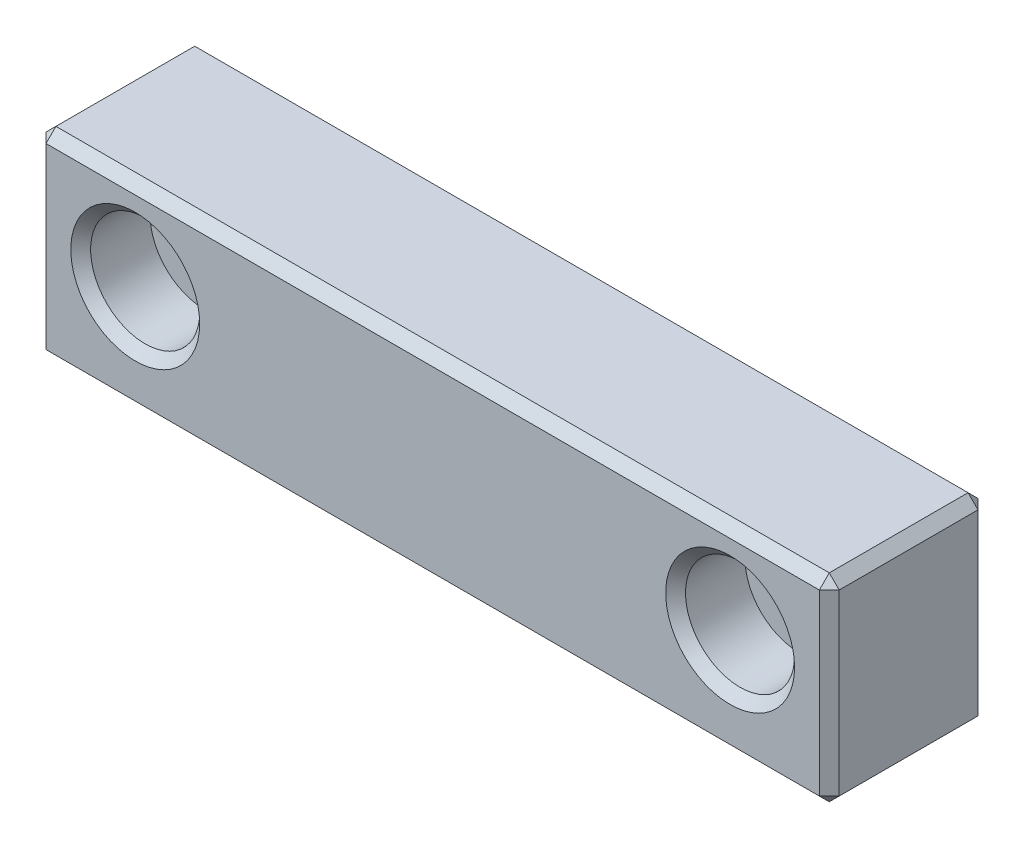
ISO-10303-21;
HEADER;
FILE_DESCRIPTION(('STEP AP214'),'2;1');
FILE_NAME('part.step','',(''),(''),'','','');
FILE_SCHEMA(('AUTOMOTIVE_DESIGN { 1 0 10303 214 1 1 1 1 }'));
ENDSEC;
DATA;
#1=APPLICATION_CONTEXT('core data for automotive mechanical design processes');
#2=APPLICATION_PROTOCOL_DEFINITION('international standard','automotive_design',2000,#1);
#3=PRODUCT_CONTEXT('',#1,'mechanical');
#4=PRODUCT('Part','Part','',(#3));
#5=PRODUCT_RELATED_PRODUCT_CATEGORY('part','',(#4));
#6=PRODUCT_DEFINITION_FORMATION('','',#4);
#7=PRODUCT_DEFINITION_CONTEXT('part definition',#1,'design');
#8=PRODUCT_DEFINITION('design','',#6,#7);
#9=PRODUCT_DEFINITION_SHAPE('','',#8);
#10=(LENGTH_UNIT() NAMED_UNIT(*) SI_UNIT(.MILLI.,.METRE.));
#11=(NAMED_UNIT(*) PLANE_ANGLE_UNIT() SI_UNIT($,.RADIAN.));
#12=(NAMED_UNIT(*) SI_UNIT($,.STERADIAN.) SOLID_ANGLE_UNIT());
#13=UNCERTAINTY_MEASURE_WITH_UNIT(LENGTH_MEASURE(1.E-05),#10,'distance_accuracy_value','');
#14=(GEOMETRIC_REPRESENTATION_CONTEXT(3) GLOBAL_UNCERTAINTY_ASSIGNED_CONTEXT((#13)) GLOBAL_UNIT_ASSIGNED_CONTEXT((#10,
#11,#12)) REPRESENTATION_CONTEXT('',''));
#15=CARTESIAN_POINT('',(0.,0.,0.));
#16=DIRECTION('',(0.,0.,1.));
#17=DIRECTION('',(1.,0.,0.));
#18=AXIS2_PLACEMENT_3D('',#15,#16,#17);
#19=CARTESIAN_POINT('',(-30.,1.,16.));
#20=DIRECTION('',(0.,0.,-1.));
#21=DIRECTION('',(-1.,0.,0.));
#22=AXIS2_PLACEMENT_3D('',#19,#20,#21);
#23=CYLINDRICAL_SURFACE('',#22,3.);
#24=CARTESIAN_POINT('',(-30.,1.,1.));
#25=DIRECTION('',(0.,0.,1.));
#26=DIRECTION('',(1.,0.,0.));
#27=AXIS2_PLACEMENT_3D('',#24,#25,#26);
#28=CIRCLE('',#27,3.);
#29=CARTESIAN_POINT('',(-27.,1.,1.));
#30=VERTEX_POINT('',#29);
#31=EDGE_CURVE('E156',#30,#30,#28,.F.);
#32=ORIENTED_EDGE('',*,*,#31,.T.);
#33=EDGE_LOOP('',(#32));
#34=FACE_BOUND('',#33,.T.);
#35=CARTESIAN_POINT('',(-30.,1.,9.));
#36=DIRECTION('',(0.,0.,1.));
#37=DIRECTION('',(1.,0.,0.));
#38=AXIS2_PLACEMENT_3D('',#35,#36,#37);
#39=CIRCLE('',#38,3.);
#40=CARTESIAN_POINT('',(-27.,1.,9.));
#41=VERTEX_POINT('',#40);
#42=EDGE_CURVE('E137',#41,#41,#39,.T.);
#43=ORIENTED_EDGE('',*,*,#42,.T.);
#44=EDGE_LOOP('',(#43));
#45=FACE_BOUND('',#44,.T.);
#46=ADVANCED_FACE('F16',(#34,#45),#23,.F.);
#47=CARTESIAN_POINT('',(30.,1.,16.));
#48=DIRECTION('',(0.,0.,-1.));
#49=DIRECTION('',(-1.,0.,0.));
#50=AXIS2_PLACEMENT_3D('',#47,#48,#49);
#51=CYLINDRICAL_SURFACE('',#50,3.);
#52=CARTESIAN_POINT('',(30.,1.,1.));
#53=DIRECTION('',(0.,0.,1.));
#54=DIRECTION('',(1.,0.,0.));
#55=AXIS2_PLACEMENT_3D('',#52,#53,#54);
#56=CIRCLE('',#55,3.);
#57=CARTESIAN_POINT('',(33.,1.,1.));
#58=VERTEX_POINT('',#57);
#59=EDGE_CURVE('E153',#58,#58,#56,.F.);
#60=ORIENTED_EDGE('',*,*,#59,.T.);
#61=EDGE_LOOP('',(#60));
#62=FACE_BOUND('',#61,.T.);
#63=CARTESIAN_POINT('',(30.,1.,9.));
#64=DIRECTION('',(0.,0.,1.));
#65=DIRECTION('',(1.,0.,0.));
#66=AXIS2_PLACEMENT_3D('',#63,#64,#65);
#67=CIRCLE('',#66,3.);
#68=CARTESIAN_POINT('',(33.,1.,9.));
#69=VERTEX_POINT('',#68);
#70=EDGE_CURVE('E274',#69,#69,#67,.T.);
#71=ORIENTED_EDGE('',*,*,#70,.T.);
#72=EDGE_LOOP('',(#71));
#73=FACE_BOUND('',#72,.T.);
#74=ADVANCED_FACE('F304',(#62,#73),#51,.F.);
#75=CARTESIAN_POINT('',(0.,0.,16.));
#76=DIRECTION('',(0.,0.,1.));
#77=DIRECTION('',(1.,0.,0.));
#78=AXIS2_PLACEMENT_3D('',#75,#76,#77);
#79=PLANE('',#78);
#80=DIRECTION('',(0.,1.,0.));
#81=VECTOR('',#80,1.);
#82=CARTESIAN_POINT('',(39.,10.,16.));
#83=LINE('',#82,#81);
#84=CARTESIAN_POINT('',(39.,-9.,16.));
#85=VERTEX_POINT('',#84);
#86=CARTESIAN_POINT('',(39.,9.,16.));
#87=VERTEX_POINT('',#86);
#88=EDGE_CURVE('E33',#85,#87,#83,.T.);
#89=ORIENTED_EDGE('',*,*,#88,.T.);
#90=DIRECTION('',(-1.,0.,0.));
#91=VECTOR('',#90,1.);
#92=CARTESIAN_POINT('',(-40.,9.,16.));
#93=LINE('',#92,#91);
#94=CARTESIAN_POINT('',(-39.,9.,16.));
#95=VERTEX_POINT('',#94);
#96=EDGE_CURVE('E203',#87,#95,#93,.T.);
#97=ORIENTED_EDGE('',*,*,#96,.T.);
#98=DIRECTION('',(0.,-1.,0.));
#99=VECTOR('',#98,1.);
#100=CARTESIAN_POINT('',(-39.,-10.,16.));
#101=LINE('',#100,#99);
#102=CARTESIAN_POINT('',(-39.,-9.,16.));
#103=VERTEX_POINT('',#102);
#104=EDGE_CURVE('E199',#95,#103,#101,.T.);
#105=ORIENTED_EDGE('',*,*,#104,.T.);
#106=DIRECTION('',(1.,0.,0.));
#107=VECTOR('',#106,1.);
#108=CARTESIAN_POINT('',(40.,-9.,16.));
#109=LINE('',#108,#107);
#110=EDGE_CURVE('E38',#103,#85,#109,.T.);
#111=ORIENTED_EDGE('',*,*,#110,.T.);
#112=EDGE_LOOP('',(#89,#97,#105,#111));
#113=FACE_BOUND('',#112,.T.);
#114=CARTESIAN_POINT('',(30.,1.,16.));
#115=DIRECTION('',(0.,0.,1.));
#116=DIRECTION('',(1.,0.,0.));
#117=AXIS2_PLACEMENT_3D('',#114,#115,#116);
#118=CIRCLE('',#117,6.5);
#119=CARTESIAN_POINT('',(36.5,1.,16.));
#120=VERTEX_POINT('',#119);
#121=EDGE_CURVE('E196',#120,#120,#118,.F.);
#122=ORIENTED_EDGE('',*,*,#121,.T.);
#123=EDGE_LOOP('',(#122));
#124=FACE_BOUND('',#123,.T.);
#125=CARTESIAN_POINT('',(-30.,1.,16.));
#126=DIRECTION('',(0.,0.,1.));
#127=DIRECTION('',(1.,0.,0.));
#128=AXIS2_PLACEMENT_3D('',#125,#126,#127);
#129=CIRCLE('',#128,6.5);
#130=CARTESIAN_POINT('',(-23.5,1.,16.));
#131=VERTEX_POINT('',#130);
#132=EDGE_CURVE('E193',#131,#131,#129,.F.);
#133=ORIENTED_EDGE('',*,*,#132,.T.);
#134=EDGE_LOOP('',(#133));
#135=FACE_BOUND('',#134,.T.);
#136=ADVANCED_FACE('F311',(#113,#124,#135),#79,.T.);
#137=CARTESIAN_POINT('',(0.,0.,0.));
#138=DIRECTION('',(0.,0.,1.));
#139=DIRECTION('',(1.,0.,0.));
#140=AXIS2_PLACEMENT_3D('',#137,#138,#139);
#141=PLANE('',#140);
#142=CARTESIAN_POINT('',(30.,1.,0.));
#143=DIRECTION('',(0.,0.,1.));
#144=DIRECTION('',(1.,0.,0.));
#145=AXIS2_PLACEMENT_3D('',#142,#143,#144);
#146=CIRCLE('',#145,4.);
#147=CARTESIAN_POINT('',(34.,1.,0.));
#148=VERTEX_POINT('',#147);
#149=EDGE_CURVE('E150',#148,#148,#146,.T.);
#150=ORIENTED_EDGE('',*,*,#149,.T.);
#151=EDGE_LOOP('',(#150));
#152=FACE_BOUND('',#151,.T.);
#153=CARTESIAN_POINT('',(-30.,1.,0.));
#154=DIRECTION('',(0.,0.,1.));
#155=DIRECTION('',(1.,0.,0.));
#156=AXIS2_PLACEMENT_3D('',#153,#154,#155);
#157=CIRCLE('',#156,4.);
#158=CARTESIAN_POINT('',(-26.,1.,0.));
#159=VERTEX_POINT('',#158);
#160=EDGE_CURVE('E144',#159,#159,#157,.T.);
#161=ORIENTED_EDGE('',*,*,#160,.T.);
#162=EDGE_LOOP('',(#161));
#163=FACE_BOUND('',#162,.T.);
#164=DIRECTION('',(0.,1.,0.));
#165=VECTOR('',#164,1.);
#166=CARTESIAN_POINT('',(-39.,0.,0.));
#167=LINE('',#166,#165);
#168=CARTESIAN_POINT('',(-39.,-9.,0.));
#169=VERTEX_POINT('',#168);
#170=CARTESIAN_POINT('',(-39.,9.,0.));
#171=VERTEX_POINT('',#170);
#172=EDGE_CURVE('E136',#169,#171,#167,.T.);
#173=ORIENTED_EDGE('',*,*,#172,.T.);
#174=DIRECTION('',(1.,0.,0.));
#175=VECTOR('',#174,1.);
#176=CARTESIAN_POINT('',(0.,9.,0.));
#177=LINE('',#176,#175);
#178=CARTESIAN_POINT('',(39.,9.,0.));
#179=VERTEX_POINT('',#178);
#180=EDGE_CURVE('E141',#171,#179,#177,.T.);
#181=ORIENTED_EDGE('',*,*,#180,.T.);
#182=DIRECTION('',(0.,-1.,0.));
#183=VECTOR('',#182,1.);
#184=CARTESIAN_POINT('',(39.,0.,0.));
#185=LINE('',#184,#183);
#186=CARTESIAN_POINT('',(39.,-9.,0.));
#187=VERTEX_POINT('',#186);
#188=EDGE_CURVE('E111',#179,#187,#185,.T.);
#189=ORIENTED_EDGE('',*,*,#188,.T.);
#190=DIRECTION('',(-1.,0.,0.));
#191=VECTOR('',#190,1.);
#192=CARTESIAN_POINT('',(0.,-9.,0.));
#193=LINE('',#192,#191);
#194=EDGE_CURVE('E130',#187,#169,#193,.T.);
#195=ORIENTED_EDGE('',*,*,#194,.T.);
#196=EDGE_LOOP('',(#173,#181,#189,#195));
#197=FACE_BOUND('',#196,.T.);
#198=ADVANCED_FACE('F139',(#152,#163,#197),#141,.F.);
#199=CARTESIAN_POINT('',(-40.,-10.,16.));
#200=DIRECTION('',(1.,0.,0.));
#201=DIRECTION('',(0.,0.,-1.));
#202=AXIS2_PLACEMENT_3D('',#199,#200,#201);
#203=PLANE('',#202);
#204=DIRECTION('',(0.,0.,-1.));
#205=VECTOR('',#204,1.);
#206=CARTESIAN_POINT('',(-40.,9.,16.));
#207=LINE('',#206,#205);
#208=CARTESIAN_POINT('',(-40.,9.,15.));
#209=VERTEX_POINT('',#208);
#210=CARTESIAN_POINT('',(-40.,9.,1.));
#211=VERTEX_POINT('',#210);
#212=EDGE_CURVE('E170',#209,#211,#207,.T.);
#213=ORIENTED_EDGE('',*,*,#212,.T.);
#214=DIRECTION('',(0.,-1.,0.));
#215=VECTOR('',#214,1.);
#216=CARTESIAN_POINT('',(-40.,-10.,1.));
#217=LINE('',#216,#215);
#218=CARTESIAN_POINT('',(-40.,-9.,1.));
#219=VERTEX_POINT('',#218);
#220=EDGE_CURVE('E172',#211,#219,#217,.T.);
#221=ORIENTED_EDGE('',*,*,#220,.T.);
#222=DIRECTION('',(0.,0.,1.));
#223=VECTOR('',#222,1.);
#224=CARTESIAN_POINT('',(-40.,-9.,16.));
#225=LINE('',#224,#223);
#226=CARTESIAN_POINT('',(-40.,-9.,15.));
#227=VERTEX_POINT('',#226);
#228=EDGE_CURVE('E168',#219,#227,#225,.T.);
#229=ORIENTED_EDGE('',*,*,#228,.T.);
#230=DIRECTION('',(0.,1.,0.));
#231=VECTOR('',#230,1.);
#232=CARTESIAN_POINT('',(-40.,10.,15.));
#233=LINE('',#232,#231);
#234=EDGE_CURVE('E166',#227,#209,#233,.T.);
#235=ORIENTED_EDGE('',*,*,#234,.T.);
#236=EDGE_LOOP('',(#213,#221,#229,#235));
#237=FACE_BOUND('',#236,.T.);
#238=ADVANCED_FACE('F320',(#237),#203,.F.);
#239=CARTESIAN_POINT('',(40.,-10.,16.));
#240=DIRECTION('',(0.,1.,0.));
#241=DIRECTION('',(-1.,0.,0.));
#242=AXIS2_PLACEMENT_3D('',#239,#240,#241);
#243=PLANE('',#242);
#244=DIRECTION('',(-1.,0.,0.));
#245=VECTOR('',#244,1.);
#246=CARTESIAN_POINT('',(-40.,-10.,15.));
#247=LINE('',#246,#245);
#248=CARTESIAN_POINT('',(39.,-10.,15.));
#249=VERTEX_POINT('',#248);
#250=CARTESIAN_POINT('',(-39.,-10.,15.));
#251=VERTEX_POINT('',#250);
#252=EDGE_CURVE('E184',#249,#251,#247,.T.);
#253=ORIENTED_EDGE('',*,*,#252,.T.);
#254=DIRECTION('',(0.,0.,-1.));
#255=VECTOR('',#254,1.);
#256=CARTESIAN_POINT('',(-39.,-10.,16.));
#257=LINE('',#256,#255);
#258=CARTESIAN_POINT('',(-39.,-10.,1.));
#259=VERTEX_POINT('',#258);
#260=EDGE_CURVE('E190',#251,#259,#257,.T.);
#261=ORIENTED_EDGE('',*,*,#260,.T.);
#262=DIRECTION('',(1.,0.,0.));
#263=VECTOR('',#262,1.);
#264=CARTESIAN_POINT('',(40.,-10.,1.));
#265=LINE('',#264,#263);
#266=CARTESIAN_POINT('',(39.,-10.,1.));
#267=VERTEX_POINT('',#266);
#268=EDGE_CURVE('E188',#259,#267,#265,.T.);
#269=ORIENTED_EDGE('',*,*,#268,.T.);
#270=DIRECTION('',(0.,0.,1.));
#271=VECTOR('',#270,1.);
#272=CARTESIAN_POINT('',(39.,-10.,16.));
#273=LINE('',#272,#271);
#274=EDGE_CURVE('E186',#267,#249,#273,.T.);
#275=ORIENTED_EDGE('',*,*,#274,.T.);
#276=EDGE_LOOP('',(#253,#261,#269,#275));
#277=FACE_BOUND('',#276,.T.);
#278=ADVANCED_FACE('F329',(#277),#243,.F.);
#279=CARTESIAN_POINT('',(40.,-10.,16.));
#280=DIRECTION('',(-1.,0.,0.));
#281=DIRECTION('',(0.,0.,1.));
#282=AXIS2_PLACEMENT_3D('',#279,#280,#281);
#283=PLANE('',#282);
#284=DIRECTION('',(0.,0.,-1.));
#285=VECTOR('',#284,1.);
#286=CARTESIAN_POINT('',(40.,-9.,16.));
#287=LINE('',#286,#285);
#288=CARTESIAN_POINT('',(40.,-9.,15.));
#289=VERTEX_POINT('',#288);
#290=CARTESIAN_POINT('',(40.,-9.,1.));
#291=VERTEX_POINT('',#290);
#292=EDGE_CURVE('E161',#289,#291,#287,.T.);
#293=ORIENTED_EDGE('',*,*,#292,.T.);
#294=DIRECTION('',(0.,1.,0.));
#295=VECTOR('',#294,1.);
#296=CARTESIAN_POINT('',(40.,-10.,1.));
#297=LINE('',#296,#295);
#298=CARTESIAN_POINT('',(40.,9.,1.));
#299=VERTEX_POINT('',#298);
#300=EDGE_CURVE('E114',#291,#299,#297,.T.);
#301=ORIENTED_EDGE('',*,*,#300,.T.);
#302=DIRECTION('',(0.,0.,1.));
#303=VECTOR('',#302,1.);
#304=CARTESIAN_POINT('',(40.,9.,16.));
#305=LINE('',#304,#303);
#306=CARTESIAN_POINT('',(40.,9.,15.));
#307=VERTEX_POINT('',#306);
#308=EDGE_CURVE('E163',#299,#307,#305,.T.);
#309=ORIENTED_EDGE('',*,*,#308,.T.);
#310=DIRECTION('',(0.,-1.,0.));
#311=VECTOR('',#310,1.);
#312=CARTESIAN_POINT('',(40.,-10.,15.));
#313=LINE('',#312,#311);
#314=EDGE_CURVE('E159',#307,#289,#313,.T.);
#315=ORIENTED_EDGE('',*,*,#314,.T.);
#316=EDGE_LOOP('',(#293,#301,#309,#315));
#317=FACE_BOUND('',#316,.T.);
#318=ADVANCED_FACE('F325',(#317),#283,.F.);
#319=CARTESIAN_POINT('',(40.,10.,16.));
#320=DIRECTION('',(0.,-1.,0.));
#321=DIRECTION('',(1.,0.,0.));
#322=AXIS2_PLACEMENT_3D('',#319,#320,#321);
#323=PLANE('',#322);
#324=DIRECTION('',(1.,0.,0.));
#325=VECTOR('',#324,1.);
#326=CARTESIAN_POINT('',(40.,10.,15.));
#327=LINE('',#326,#325);
#328=CARTESIAN_POINT('',(-39.,10.,15.));
#329=VERTEX_POINT('',#328);
#330=CARTESIAN_POINT('',(39.,10.,15.));
#331=VERTEX_POINT('',#330);
#332=EDGE_CURVE('E175',#329,#331,#327,.T.);
#333=ORIENTED_EDGE('',*,*,#332,.T.);
#334=DIRECTION('',(0.,0.,-1.));
#335=VECTOR('',#334,1.);
#336=CARTESIAN_POINT('',(39.,10.,16.));
#337=LINE('',#336,#335);
#338=CARTESIAN_POINT('',(39.,10.,1.));
#339=VERTEX_POINT('',#338);
#340=EDGE_CURVE('E181',#331,#339,#337,.T.);
#341=ORIENTED_EDGE('',*,*,#340,.T.);
#342=DIRECTION('',(-1.,0.,0.));
#343=VECTOR('',#342,1.);
#344=CARTESIAN_POINT('',(40.,10.,1.));
#345=LINE('',#344,#343);
#346=CARTESIAN_POINT('',(-39.,10.,1.));
#347=VERTEX_POINT('',#346);
#348=EDGE_CURVE('E179',#339,#347,#345,.T.);
#349=ORIENTED_EDGE('',*,*,#348,.T.);
#350=DIRECTION('',(0.,0.,1.));
#351=VECTOR('',#350,1.);
#352=CARTESIAN_POINT('',(-39.,10.,16.));
#353=LINE('',#352,#351);
#354=EDGE_CURVE('E177',#347,#329,#353,.T.);
#355=ORIENTED_EDGE('',*,*,#354,.T.);
#356=EDGE_LOOP('',(#333,#341,#349,#355));
#357=FACE_BOUND('',#356,.T.);
#358=ADVANCED_FACE('F322',(#357),#323,.F.);
#359=CARTESIAN_POINT('',(30.,1.,9.));
#360=DIRECTION('',(0.,0.,1.));
#361=DIRECTION('',(1.,0.,0.));
#362=AXIS2_PLACEMENT_3D('',#359,#360,#361);
#363=CYLINDRICAL_SURFACE('',#362,5.5);
#364=CARTESIAN_POINT('',(30.,1.,15.));
#365=DIRECTION('',(0.,0.,1.));
#366=DIRECTION('',(1.,0.,0.));
#367=AXIS2_PLACEMENT_3D('',#364,#365,#366);
#368=CIRCLE('',#367,5.5);
#369=CARTESIAN_POINT('',(35.5,1.,15.));
#370=VERTEX_POINT('',#369);
#371=EDGE_CURVE('E25',#370,#370,#368,.T.);
#372=ORIENTED_EDGE('',*,*,#371,.T.);
#373=EDGE_LOOP('',(#372));
#374=FACE_BOUND('',#373,.T.);
#375=CARTESIAN_POINT('',(30.,1.,9.));
#376=DIRECTION('',(0.,0.,1.));
#377=DIRECTION('',(1.,0.,0.));
#378=AXIS2_PLACEMENT_3D('',#375,#376,#377);
#379=CIRCLE('',#378,5.5);
#380=CARTESIAN_POINT('',(35.5,1.,9.));
#381=VERTEX_POINT('',#380);
#382=EDGE_CURVE('E263',#381,#381,#379,.T.);
#383=ORIENTED_EDGE('',*,*,#382,.F.);
#384=EDGE_LOOP('',(#383));
#385=FACE_BOUND('',#384,.T.);
#386=ADVANCED_FACE('F300',(#374,#385),#363,.F.);
#387=CARTESIAN_POINT('',(30.,1.,9.));
#388=DIRECTION('',(0.,0.,1.));
#389=DIRECTION('',(1.,0.,0.));
#390=AXIS2_PLACEMENT_3D('',#387,#388,#389);
#391=PLANE('',#390);
#392=ORIENTED_EDGE('',*,*,#70,.F.);
#393=EDGE_LOOP('',(#392));
#394=FACE_BOUND('',#393,.T.);
#395=ORIENTED_EDGE('',*,*,#382,.T.);
#396=EDGE_LOOP('',(#395));
#397=FACE_BOUND('',#396,.T.);
#398=ADVANCED_FACE('F292',(#394,#397),#391,.T.);
#399=CARTESIAN_POINT('',(-30.,1.,9.));
#400=DIRECTION('',(0.,0.,1.));
#401=DIRECTION('',(1.,0.,0.));
#402=AXIS2_PLACEMENT_3D('',#399,#400,#401);
#403=CYLINDRICAL_SURFACE('',#402,5.5);
#404=CARTESIAN_POINT('',(-30.,1.,15.));
#405=DIRECTION('',(0.,0.,1.));
#406=DIRECTION('',(1.,0.,0.));
#407=AXIS2_PLACEMENT_3D('',#404,#405,#406);
#408=CIRCLE('',#407,5.5);
#409=CARTESIAN_POINT('',(-24.5,1.,15.));
#410=VERTEX_POINT('',#409);
#411=EDGE_CURVE('E10',#410,#410,#408,.T.);
#412=ORIENTED_EDGE('',*,*,#411,.T.);
#413=EDGE_LOOP('',(#412));
#414=FACE_BOUND('',#413,.T.);
#415=CARTESIAN_POINT('',(-30.,1.,9.));
#416=DIRECTION('',(0.,0.,1.));
#417=DIRECTION('',(1.,0.,0.));
#418=AXIS2_PLACEMENT_3D('',#415,#416,#417);
#419=CIRCLE('',#418,5.5);
#420=CARTESIAN_POINT('',(-24.5,1.,9.));
#421=VERTEX_POINT('',#420);
#422=EDGE_CURVE('E269',#421,#421,#419,.T.);
#423=ORIENTED_EDGE('',*,*,#422,.F.);
#424=EDGE_LOOP('',(#423));
#425=FACE_BOUND('',#424,.T.);
#426=ADVANCED_FACE('F287',(#414,#425),#403,.F.);
#427=CARTESIAN_POINT('',(-30.,1.,9.));
#428=DIRECTION('',(0.,0.,1.));
#429=DIRECTION('',(1.,0.,0.));
#430=AXIS2_PLACEMENT_3D('',#427,#428,#429);
#431=PLANE('',#430);
#432=ORIENTED_EDGE('',*,*,#42,.F.);
#433=EDGE_LOOP('',(#432));
#434=FACE_BOUND('',#433,.T.);
#435=ORIENTED_EDGE('',*,*,#422,.T.);
#436=EDGE_LOOP('',(#435));
#437=FACE_BOUND('',#436,.T.);
#438=ADVANCED_FACE('F283',(#434,#437),#431,.T.);
#439=CARTESIAN_POINT('',(30.,1.,0.));
#440=DIRECTION('',(0.,0.,-1.));
#441=DIRECTION('',(-1.,0.,0.));
#442=AXIS2_PLACEMENT_3D('',#439,#440,#441);
#443=CONICAL_SURFACE('',#442,4.,0.78539816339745);
#444=ORIENTED_EDGE('',*,*,#59,.F.);
#445=EDGE_LOOP('',(#444));
#446=FACE_BOUND('',#445,.T.);
#447=ORIENTED_EDGE('',*,*,#149,.F.);
#448=EDGE_LOOP('',(#447));
#449=FACE_BOUND('',#448,.T.);
#450=ADVANCED_FACE('F286',(#446,#449),#443,.F.);
#451=CARTESIAN_POINT('',(-30.,1.,0.));
#452=DIRECTION('',(0.,0.,-1.));
#453=DIRECTION('',(-1.,0.,0.));
#454=AXIS2_PLACEMENT_3D('',#451,#452,#453);
#455=CONICAL_SURFACE('',#454,4.,0.785398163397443);
#456=ORIENTED_EDGE('',*,*,#31,.F.);
#457=EDGE_LOOP('',(#456));
#458=FACE_BOUND('',#457,.T.);
#459=ORIENTED_EDGE('',*,*,#160,.F.);
#460=EDGE_LOOP('',(#459));
#461=FACE_BOUND('',#460,.T.);
#462=ADVANCED_FACE('F339',(#458,#461),#455,.F.);
#463=CARTESIAN_POINT('',(-39.,0.,16.));
#464=DIRECTION('',(-0.70710678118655,0.,0.707106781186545));
#465=DIRECTION('',(0.,1.,0.));
#466=AXIS2_PLACEMENT_3D('',#463,#464,#465);
#467=PLANE('',#466);
#468=DIRECTION('',(-0.707106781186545,0.,-0.70710678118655));
#469=VECTOR('',#468,1.);
#470=CARTESIAN_POINT('',(-40.,-9.,15.));
#471=LINE('',#470,#469);
#472=EDGE_CURVE('E20',#103,#227,#471,.T.);
#473=ORIENTED_EDGE('',*,*,#472,.F.);
#474=ORIENTED_EDGE('',*,*,#104,.F.);
#475=DIRECTION('',(0.707106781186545,0.,0.70710678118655));
#476=VECTOR('',#475,1.);
#477=CARTESIAN_POINT('',(-39.5,9.,15.5));
#478=LINE('',#477,#476);
#479=EDGE_CURVE('E255',#209,#95,#478,.T.);
#480=ORIENTED_EDGE('',*,*,#479,.F.);
#481=ORIENTED_EDGE('',*,*,#234,.F.);
#482=EDGE_LOOP('',(#473,#474,#480,#481));
#483=FACE_BOUND('',#482,.T.);
#484=ADVANCED_FACE('F343',(#483),#467,.T.);
#485=CARTESIAN_POINT('',(-40.,-9.,15.));
#486=DIRECTION('',(-0.577350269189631,-0.577350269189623,0.577350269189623));
#487=DIRECTION('',(0.707106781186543,0.,0.707106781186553));
#488=AXIS2_PLACEMENT_3D('',#485,#486,#487);
#489=PLANE('',#488);
#490=DIRECTION('',(0.,0.707106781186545,0.70710678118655));
#491=VECTOR('',#490,1.);
#492=CARTESIAN_POINT('',(-39.,-9.5,15.5));
#493=LINE('',#492,#491);
#494=EDGE_CURVE('E250',#103,#251,#493,.F.);
#495=ORIENTED_EDGE('',*,*,#494,.F.);
#496=ORIENTED_EDGE('',*,*,#472,.T.);
#497=DIRECTION('',(-0.707106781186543,0.707106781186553,0.));
#498=VECTOR('',#497,1.);
#499=CARTESIAN_POINT('',(-40.,-9.,15.));
#500=LINE('',#499,#498);
#501=EDGE_CURVE('E253',#251,#227,#500,.T.);
#502=ORIENTED_EDGE('',*,*,#501,.F.);
#503=EDGE_LOOP('',(#495,#496,#502));
#504=FACE_BOUND('',#503,.T.);
#505=ADVANCED_FACE('F411',(#504),#489,.T.);
#506=CARTESIAN_POINT('',(-39.,10.,15.));
#507=DIRECTION('',(-0.57735026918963,0.577350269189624,0.577350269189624));
#508=DIRECTION('',(0.707106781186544,0.,0.707106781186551));
#509=AXIS2_PLACEMENT_3D('',#506,#507,#508);
#510=PLANE('',#509);
#511=DIRECTION('',(0.707106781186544,0.707106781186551,0.));
#512=VECTOR('',#511,1.);
#513=CARTESIAN_POINT('',(-39.,10.,15.));
#514=LINE('',#513,#512);
#515=EDGE_CURVE('E245',#209,#329,#514,.T.);
#516=ORIENTED_EDGE('',*,*,#515,.F.);
#517=ORIENTED_EDGE('',*,*,#479,.T.);
#518=DIRECTION('',(0.,0.707106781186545,-0.70710678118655));
#519=VECTOR('',#518,1.);
#520=CARTESIAN_POINT('',(-39.,10.,15.));
#521=LINE('',#520,#519);
#522=EDGE_CURVE('E248',#329,#95,#521,.F.);
#523=ORIENTED_EDGE('',*,*,#522,.F.);
#524=EDGE_LOOP('',(#516,#517,#523));
#525=FACE_BOUND('',#524,.T.);
#526=ADVANCED_FACE('F407',(#525),#510,.T.);
#527=CARTESIAN_POINT('',(-39.,-10.,16.));
#528=DIRECTION('',(0.707106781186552,0.707106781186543,0.));
#529=DIRECTION('',(0.,0.,-1.));
#530=AXIS2_PLACEMENT_3D('',#527,#528,#529);
#531=PLANE('',#530);
#532=ORIENTED_EDGE('',*,*,#501,.T.);
#533=ORIENTED_EDGE('',*,*,#228,.F.);
#534=DIRECTION('',(0.707106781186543,-0.707106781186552,0.));
#535=VECTOR('',#534,1.);
#536=CARTESIAN_POINT('',(-40.,-9.,1.));
#537=LINE('',#536,#535);
#538=EDGE_CURVE('E240',#259,#219,#537,.F.);
#539=ORIENTED_EDGE('',*,*,#538,.F.);
#540=ORIENTED_EDGE('',*,*,#260,.F.);
#541=EDGE_LOOP('',(#532,#533,#539,#540));
#542=FACE_BOUND('',#541,.T.);
#543=ADVANCED_FACE('F403',(#542),#531,.F.);
#544=CARTESIAN_POINT('',(0.,-9.,16.));
#545=DIRECTION('',(0.,-0.70710678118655,0.707106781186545));
#546=DIRECTION('',(-1.,0.,0.));
#547=AXIS2_PLACEMENT_3D('',#544,#545,#546);
#548=PLANE('',#547);
#549=ORIENTED_EDGE('',*,*,#494,.T.);
#550=ORIENTED_EDGE('',*,*,#252,.F.);
#551=DIRECTION('',(0.,-0.707106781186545,-0.70710678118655));
#552=VECTOR('',#551,1.);
#553=CARTESIAN_POINT('',(39.,-10.,15.));
#554=LINE('',#553,#552);
#555=EDGE_CURVE('E237',#85,#249,#554,.T.);
#556=ORIENTED_EDGE('',*,*,#555,.F.);
#557=ORIENTED_EDGE('',*,*,#110,.F.);
#558=EDGE_LOOP('',(#549,#550,#556,#557));
#559=FACE_BOUND('',#558,.T.);
#560=ADVANCED_FACE('F399',(#559),#548,.T.);
#561=CARTESIAN_POINT('',(39.,0.,16.));
#562=DIRECTION('',(0.70710678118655,0.,0.707106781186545));
#563=DIRECTION('',(0.,-1.,0.));
#564=AXIS2_PLACEMENT_3D('',#561,#562,#563);
#565=PLANE('',#564);
#566=DIRECTION('',(0.707106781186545,0.,-0.70710678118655));
#567=VECTOR('',#566,1.);
#568=CARTESIAN_POINT('',(40.,9.,15.));
#569=LINE('',#568,#567);
#570=EDGE_CURVE('E231',#87,#307,#569,.T.);
#571=ORIENTED_EDGE('',*,*,#570,.F.);
#572=ORIENTED_EDGE('',*,*,#88,.F.);
#573=DIRECTION('',(-0.707106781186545,0.,0.70710678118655));
#574=VECTOR('',#573,1.);
#575=CARTESIAN_POINT('',(39.5,-9.,15.5));
#576=LINE('',#575,#574);
#577=EDGE_CURVE('E234',#289,#85,#576,.T.);
#578=ORIENTED_EDGE('',*,*,#577,.F.);
#579=ORIENTED_EDGE('',*,*,#314,.F.);
#580=EDGE_LOOP('',(#571,#572,#578,#579));
#581=FACE_BOUND('',#580,.T.);
#582=ADVANCED_FACE('F395',(#581),#565,.T.);
#583=CARTESIAN_POINT('',(0.,9.,16.));
#584=DIRECTION('',(0.,0.70710678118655,0.707106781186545));
#585=DIRECTION('',(1.,0.,0.));
#586=AXIS2_PLACEMENT_3D('',#583,#584,#585);
#587=PLANE('',#586);
#588=ORIENTED_EDGE('',*,*,#522,.T.);
#589=ORIENTED_EDGE('',*,*,#96,.F.);
#590=DIRECTION('',(0.,-0.707106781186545,0.70710678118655));
#591=VECTOR('',#590,1.);
#592=CARTESIAN_POINT('',(39.,9.5,15.5));
#593=LINE('',#592,#591);
#594=EDGE_CURVE('E228',#331,#87,#593,.T.);
#595=ORIENTED_EDGE('',*,*,#594,.F.);
#596=ORIENTED_EDGE('',*,*,#332,.F.);
#597=EDGE_LOOP('',(#588,#589,#595,#596));
#598=FACE_BOUND('',#597,.T.);
#599=ADVANCED_FACE('F391',(#598),#587,.T.);
#600=CARTESIAN_POINT('',(-40.,9.,16.));
#601=DIRECTION('',(0.707106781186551,-0.707106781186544,0.));
#602=DIRECTION('',(0.,0.,-1.));
#603=AXIS2_PLACEMENT_3D('',#600,#601,#602);
#604=PLANE('',#603);
#605=ORIENTED_EDGE('',*,*,#515,.T.);
#606=ORIENTED_EDGE('',*,*,#354,.F.);
#607=DIRECTION('',(-0.707106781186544,-0.707106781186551,0.));
#608=VECTOR('',#607,1.);
#609=CARTESIAN_POINT('',(-39.5,9.5,1.));
#610=LINE('',#609,#608);
#611=EDGE_CURVE('E225',#211,#347,#610,.F.);
#612=ORIENTED_EDGE('',*,*,#611,.F.);
#613=ORIENTED_EDGE('',*,*,#212,.F.);
#614=EDGE_LOOP('',(#605,#606,#612,#613));
#615=FACE_BOUND('',#614,.T.);
#616=ADVANCED_FACE('F387',(#615),#604,.F.);
#617=CARTESIAN_POINT('',(-40.,-10.,1.));
#618=DIRECTION('',(0.70710678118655,0.,0.707106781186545));
#619=DIRECTION('',(0.,-1.,0.));
#620=AXIS2_PLACEMENT_3D('',#617,#618,#619);
#621=PLANE('',#620);
#622=DIRECTION('',(-0.707106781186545,0.,0.70710678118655));
#623=VECTOR('',#622,1.);
#624=CARTESIAN_POINT('',(-40.,-9.,1.));
#625=LINE('',#624,#623);
#626=EDGE_CURVE('E242',#219,#169,#625,.F.);
#627=ORIENTED_EDGE('',*,*,#626,.F.);
#628=ORIENTED_EDGE('',*,*,#220,.F.);
#629=DIRECTION('',(0.707106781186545,0.,-0.70710678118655));
#630=VECTOR('',#629,1.);
#631=CARTESIAN_POINT('',(-39.,9.,0.));
#632=LINE('',#631,#630);
#633=EDGE_CURVE('E222',#171,#211,#632,.F.);
#634=ORIENTED_EDGE('',*,*,#633,.F.);
#635=ORIENTED_EDGE('',*,*,#172,.F.);
#636=EDGE_LOOP('',(#627,#628,#634,#635));
#637=FACE_BOUND('',#636,.T.);
#638=ADVANCED_FACE('F383',(#637),#621,.F.);
#639=CARTESIAN_POINT('',(-40.,-9.,1.));
#640=DIRECTION('',(-0.577350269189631,-0.577350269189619,-0.577350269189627));
#641=DIRECTION('',(-0.707106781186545,0.,0.70710678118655));
#642=AXIS2_PLACEMENT_3D('',#639,#640,#641);
#643=PLANE('',#642);
#644=ORIENTED_EDGE('',*,*,#538,.T.);
#645=ORIENTED_EDGE('',*,*,#626,.T.);
#646=DIRECTION('',(0.,0.70710678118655,-0.707106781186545));
#647=VECTOR('',#646,1.);
#648=CARTESIAN_POINT('',(-39.,-9.5,0.5));
#649=LINE('',#648,#647);
#650=EDGE_CURVE('E133',#259,#169,#649,.T.);
#651=ORIENTED_EDGE('',*,*,#650,.F.);
#652=EDGE_LOOP('',(#644,#645,#651));
#653=FACE_BOUND('',#652,.T.);
#654=ADVANCED_FACE('F379',(#653),#643,.T.);
#655=CARTESIAN_POINT('',(39.,-10.,15.));
#656=DIRECTION('',(0.577350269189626,-0.57735026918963,0.577350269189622));
#657=DIRECTION('',(0.70710678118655,0.707106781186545,0.));
#658=AXIS2_PLACEMENT_3D('',#655,#656,#657);
#659=PLANE('',#658);
#660=ORIENTED_EDGE('',*,*,#577,.T.);
#661=ORIENTED_EDGE('',*,*,#555,.T.);
#662=DIRECTION('',(-0.70710678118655,-0.707106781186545,0.));
#663=VECTOR('',#662,1.);
#664=CARTESIAN_POINT('',(39.,-10.,15.));
#665=LINE('',#664,#663);
#666=EDGE_CURVE('E218',#289,#249,#665,.T.);
#667=ORIENTED_EDGE('',*,*,#666,.F.);
#668=EDGE_LOOP('',(#660,#661,#667));
#669=FACE_BOUND('',#668,.T.);
#670=ADVANCED_FACE('F375',(#669),#659,.T.);
#671=CARTESIAN_POINT('',(40.,9.,15.));
#672=DIRECTION('',(0.57735026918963,0.577350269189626,0.577350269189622));
#673=DIRECTION('',(-0.707106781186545,0.70710678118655,0.));
#674=AXIS2_PLACEMENT_3D('',#671,#672,#673);
#675=PLANE('',#674);
#676=ORIENTED_EDGE('',*,*,#594,.T.);
#677=ORIENTED_EDGE('',*,*,#570,.T.);
#678=DIRECTION('',(0.707106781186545,-0.70710678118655,0.));
#679=VECTOR('',#678,1.);
#680=CARTESIAN_POINT('',(40.,9.,15.));
#681=LINE('',#680,#679);
#682=EDGE_CURVE('E215',#331,#307,#681,.T.);
#683=ORIENTED_EDGE('',*,*,#682,.F.);
#684=EDGE_LOOP('',(#676,#677,#683));
#685=FACE_BOUND('',#684,.T.);
#686=ADVANCED_FACE('F371',(#685),#675,.T.);
#687=CARTESIAN_POINT('',(-39.,9.,0.));
#688=DIRECTION('',(-0.57735026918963,0.57735026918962,-0.577350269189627));
#689=DIRECTION('',(-0.707106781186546,0.,0.707106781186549));
#690=AXIS2_PLACEMENT_3D('',#687,#688,#689);
#691=PLANE('',#690);
#692=ORIENTED_EDGE('',*,*,#633,.T.);
#693=ORIENTED_EDGE('',*,*,#611,.T.);
#694=DIRECTION('',(0.,0.70710678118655,0.707106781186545));
#695=VECTOR('',#694,1.);
#696=CARTESIAN_POINT('',(-39.,9.,0.));
#697=LINE('',#696,#695);
#698=EDGE_CURVE('E127',#171,#347,#697,.T.);
#699=ORIENTED_EDGE('',*,*,#698,.F.);
#700=EDGE_LOOP('',(#692,#693,#699));
#701=FACE_BOUND('',#700,.T.);
#702=ADVANCED_FACE('F368',(#701),#691,.T.);
#703=CARTESIAN_POINT('',(40.,-10.,1.));
#704=DIRECTION('',(0.,0.707106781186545,0.70710678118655));
#705=DIRECTION('',(1.,0.,0.));
#706=AXIS2_PLACEMENT_3D('',#703,#704,#705);
#707=PLANE('',#706);
#708=ORIENTED_EDGE('',*,*,#650,.T.);
#709=ORIENTED_EDGE('',*,*,#194,.F.);
#710=DIRECTION('',(0.,-0.70710678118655,0.707106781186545));
#711=VECTOR('',#710,1.);
#712=CARTESIAN_POINT('',(39.,-9.,0.));
#713=LINE('',#712,#711);
#714=EDGE_CURVE('E121',#267,#187,#713,.F.);
#715=ORIENTED_EDGE('',*,*,#714,.F.);
#716=ORIENTED_EDGE('',*,*,#268,.F.);
#717=EDGE_LOOP('',(#708,#709,#715,#716));
#718=FACE_BOUND('',#717,.T.);
#719=ADVANCED_FACE('F131',(#718),#707,.F.);
#720=CARTESIAN_POINT('',(40.,-9.,16.));
#721=DIRECTION('',(-0.707106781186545,0.70710678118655,0.));
#722=DIRECTION('',(0.,0.,-1.));
#723=AXIS2_PLACEMENT_3D('',#720,#721,#722);
#724=PLANE('',#723);
#725=ORIENTED_EDGE('',*,*,#666,.T.);
#726=ORIENTED_EDGE('',*,*,#274,.F.);
#727=DIRECTION('',(0.70710678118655,0.707106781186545,0.));
#728=VECTOR('',#727,1.);
#729=CARTESIAN_POINT('',(39.5,-9.5,1.));
#730=LINE('',#729,#728);
#731=EDGE_CURVE('E125',#291,#267,#730,.F.);
#732=ORIENTED_EDGE('',*,*,#731,.F.);
#733=ORIENTED_EDGE('',*,*,#292,.F.);
#734=EDGE_LOOP('',(#725,#726,#732,#733));
#735=FACE_BOUND('',#734,.T.);
#736=ADVANCED_FACE('F361',(#735),#724,.F.);
#737=CARTESIAN_POINT('',(39.,10.,16.));
#738=DIRECTION('',(-0.70710678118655,-0.707106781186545,0.));
#739=DIRECTION('',(0.,0.,-1.));
#740=AXIS2_PLACEMENT_3D('',#737,#738,#739);
#741=PLANE('',#740);
#742=ORIENTED_EDGE('',*,*,#682,.T.);
#743=ORIENTED_EDGE('',*,*,#308,.F.);
#744=DIRECTION('',(-0.707106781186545,0.70710678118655,0.));
#745=VECTOR('',#744,1.);
#746=CARTESIAN_POINT('',(40.,9.,1.));
#747=LINE('',#746,#745);
#748=EDGE_CURVE('E209',#339,#299,#747,.F.);
#749=ORIENTED_EDGE('',*,*,#748,.F.);
#750=ORIENTED_EDGE('',*,*,#340,.F.);
#751=EDGE_LOOP('',(#742,#743,#749,#750));
#752=FACE_BOUND('',#751,.T.);
#753=ADVANCED_FACE('F357',(#752),#741,.F.);
#754=CARTESIAN_POINT('',(40.,10.,1.));
#755=DIRECTION('',(0.,-0.707106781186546,0.70710678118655));
#756=DIRECTION('',(-1.,0.,0.));
#757=AXIS2_PLACEMENT_3D('',#754,#755,#756);
#758=PLANE('',#757);
#759=ORIENTED_EDGE('',*,*,#698,.T.);
#760=ORIENTED_EDGE('',*,*,#348,.F.);
#761=DIRECTION('',(0.,-0.70710678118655,-0.707106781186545));
#762=VECTOR('',#761,1.);
#763=CARTESIAN_POINT('',(39.,9.5,0.5));
#764=LINE('',#763,#762);
#765=EDGE_CURVE('E117',#179,#339,#764,.F.);
#766=ORIENTED_EDGE('',*,*,#765,.F.);
#767=ORIENTED_EDGE('',*,*,#180,.F.);
#768=EDGE_LOOP('',(#759,#760,#766,#767));
#769=FACE_BOUND('',#768,.T.);
#770=ADVANCED_FACE('F354',(#769),#758,.F.);
#771=CARTESIAN_POINT('',(39.,-9.,0.));
#772=DIRECTION('',(0.577350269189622,-0.577350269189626,-0.57735026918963));
#773=DIRECTION('',(0.,0.70710678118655,-0.707106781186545));
#774=AXIS2_PLACEMENT_3D('',#771,#772,#773);
#775=PLANE('',#774);
#776=ORIENTED_EDGE('',*,*,#731,.T.);
#777=ORIENTED_EDGE('',*,*,#714,.T.);
#778=DIRECTION('',(-0.70710678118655,0.,-0.707106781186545));
#779=VECTOR('',#778,1.);
#780=CARTESIAN_POINT('',(39.,-9.,0.));
#781=LINE('',#780,#779);
#782=EDGE_CURVE('E107',#291,#187,#781,.T.);
#783=ORIENTED_EDGE('',*,*,#782,.F.);
#784=EDGE_LOOP('',(#776,#777,#783));
#785=FACE_BOUND('',#784,.T.);
#786=ADVANCED_FACE('F123',(#785),#775,.T.);
#787=CARTESIAN_POINT('',(40.,9.,1.));
#788=DIRECTION('',(0.577350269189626,0.577350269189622,-0.577350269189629));
#789=DIRECTION('',(-0.707106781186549,0.,-0.707106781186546));
#790=AXIS2_PLACEMENT_3D('',#787,#788,#789);
#791=PLANE('',#790);
#792=ORIENTED_EDGE('',*,*,#765,.T.);
#793=ORIENTED_EDGE('',*,*,#748,.T.);
#794=DIRECTION('',(0.70710678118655,0.,0.707106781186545));
#795=VECTOR('',#794,1.);
#796=CARTESIAN_POINT('',(40.,9.,1.));
#797=LINE('',#796,#795);
#798=EDGE_CURVE('E118',#179,#299,#797,.T.);
#799=ORIENTED_EDGE('',*,*,#798,.F.);
#800=EDGE_LOOP('',(#792,#793,#799));
#801=FACE_BOUND('',#800,.T.);
#802=ADVANCED_FACE('F348',(#801),#791,.T.);
#803=CARTESIAN_POINT('',(40.,-10.,1.));
#804=DIRECTION('',(-0.707106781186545,0.,0.70710678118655));
#805=DIRECTION('',(0.,1.,0.));
#806=AXIS2_PLACEMENT_3D('',#803,#804,#805);
#807=PLANE('',#806);
#808=ORIENTED_EDGE('',*,*,#782,.T.);
#809=ORIENTED_EDGE('',*,*,#188,.F.);
#810=ORIENTED_EDGE('',*,*,#798,.T.);
#811=ORIENTED_EDGE('',*,*,#300,.F.);
#812=EDGE_LOOP('',(#808,#809,#810,#811));
#813=FACE_BOUND('',#812,.T.);
#814=ADVANCED_FACE('F109',(#813),#807,.F.);
#815=CARTESIAN_POINT('',(30.,1.,15.));
#816=DIRECTION('',(0.,0.,1.));
#817=DIRECTION('',(1.,0.,0.));
#818=AXIS2_PLACEMENT_3D('',#815,#816,#817);
#819=CONICAL_SURFACE('',#818,5.5,0.785398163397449);
#820=ORIENTED_EDGE('',*,*,#121,.F.);
#821=EDGE_LOOP('',(#820));
#822=FACE_BOUND('',#821,.T.);
#823=ORIENTED_EDGE('',*,*,#371,.F.);
#824=EDGE_LOOP('',(#823));
#825=FACE_BOUND('',#824,.T.);
#826=ADVANCED_FACE('F347',(#822,#825),#819,.F.);
#827=CARTESIAN_POINT('',(-30.,1.,15.));
#828=DIRECTION('',(0.,0.,1.));
#829=DIRECTION('',(1.,0.,0.));
#830=AXIS2_PLACEMENT_3D('',#827,#828,#829);
#831=CONICAL_SURFACE('',#830,5.5,0.785398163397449);
#832=ORIENTED_EDGE('',*,*,#132,.F.);
#833=EDGE_LOOP('',(#832));
#834=FACE_BOUND('',#833,.T.);
#835=ORIENTED_EDGE('',*,*,#411,.F.);
#836=EDGE_LOOP('',(#835));
#837=FACE_BOUND('',#836,.T.);
#838=ADVANCED_FACE('F18',(#834,#837),#831,.F.);
#839=CLOSED_SHELL('',(#46,#74,#136,#198,#238,#278,#318,#358,#386,#398,#426,#438,#450,#462,#484,
#505,#526,#543,#560,#582,#599,#616,#638,#654,#670,#686,#702,#719,#736,#753,#770,#786,#802,#814,
#826,#838));
#840=MANIFOLD_SOLID_BREP('B1',#839);
#841=ADVANCED_BREP_SHAPE_REPRESENTATION('',(#18,#840),#14);
#842=SHAPE_DEFINITION_REPRESENTATION(#9,#841);
ENDSEC;
END-ISO-10303-21;
